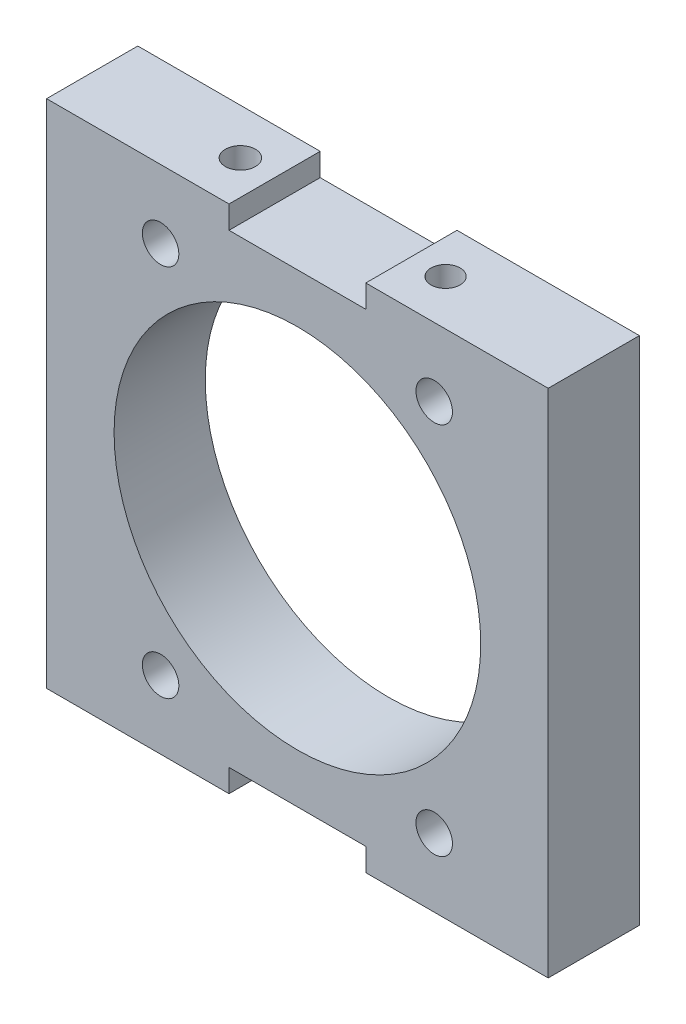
from build123d import *

# Parameters (mm, degrees)
SCHIZZO1_R                   = 40.2
SCHIZZO1_R_2                 = 4
ESTRUSIONE_ESTRUSIONE3_DEPTH = 20
M6_CLEARANCE_HOLE3_D         = 6.4
M6_CLEARANCE_HOLE3_DEPTH     = 15
M6_CLEARANCE_HOLE3_TIP       = 1.922753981
M6_CLEARANCE_HOLE2_D         = 6.4
M6_CLEARANCE_HOLE2_DEPTH     = 15
M6_CLEARANCE_HOLE2_TIP       = 1.922753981
M6_CLEARANCE_HOLE1_D         = 6.6
M6_CLEARANCE_HOLE1_DEPTH     = 15
M6_CLEARANCE_HOLE1_TIP       = 1.982840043


with BuildPart() as part:
    # Schizzo1 → Estrusione-Estrusione3 (new body)
    with BuildSketch(Plane.XY):
        Polygon((-15, 56), (-15, 51), (15, 51), (15, 56), (55, 56), (55, -56), (15, -56), (15, -51), (-15, -51), (-15, -56), (-55, -56), (-55, 56), align=None)
        Circle(SCHIZZO1_R, mode=Mode.SUBTRACT)
        with Locations((-30, 41)):
            Circle(SCHIZZO1_R_2, mode=Mode.SUBTRACT)
        with Locations((-30, -41)):
            Circle(SCHIZZO1_R_2, mode=Mode.SUBTRACT)
        with Locations((30, 41)):
            Circle(SCHIZZO1_R_2, mode=Mode.SUBTRACT)
        with Locations((30, -41)):
            Circle(SCHIZZO1_R_2, mode=Mode.SUBTRACT)
    extrude(amount=ESTRUSIONE_ESTRUSIONE3_DEPTH)

    # M6 Clearance Hole3
    with Locations(Plane(origin=(0, 56, 0), x_dir=(1, 0, 0), z_dir=(0, 1, 0))):
        with Locations((22.522113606, -10.034405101), (22.5, -10)):
            Hole(M6_CLEARANCE_HOLE3_D / 2, depth=M6_CLEARANCE_HOLE3_DEPTH)
            with Locations((0, 0, -(M6_CLEARANCE_HOLE3_DEPTH + M6_CLEARANCE_HOLE3_TIP / 2))):  # 118° drill point
                Cone(0, M6_CLEARANCE_HOLE3_D / 2, M6_CLEARANCE_HOLE3_TIP, mode=Mode.SUBTRACT)

    # M6 Clearance Hole2
    with Locations(Plane(origin=(0, -56, 0), x_dir=(-1, 0, 0), z_dir=(0, -1, 0))):
        with Locations((-22.5, -10), (22.5, -10)):
            Hole(M6_CLEARANCE_HOLE2_D / 2, depth=M6_CLEARANCE_HOLE2_DEPTH)
            with Locations((0, 0, -(M6_CLEARANCE_HOLE2_DEPTH + M6_CLEARANCE_HOLE2_TIP / 2))):  # 118° drill point
                Cone(0, M6_CLEARANCE_HOLE2_D / 2, M6_CLEARANCE_HOLE2_TIP, mode=Mode.SUBTRACT)

    # M6 Clearance Hole1
    with Locations(Plane(origin=(0, 56, 0), x_dir=(1, 0, 0), z_dir=(0, 1, 0))):
        with Locations((-22.5, -10)):
            Hole(M6_CLEARANCE_HOLE1_D / 2, depth=M6_CLEARANCE_HOLE1_DEPTH)
            with Locations((0, 0, -(M6_CLEARANCE_HOLE1_DEPTH + M6_CLEARANCE_HOLE1_TIP / 2))):  # 118° drill point
                Cone(0, M6_CLEARANCE_HOLE1_D / 2, M6_CLEARANCE_HOLE1_TIP, mode=Mode.SUBTRACT)


solid = part.part
